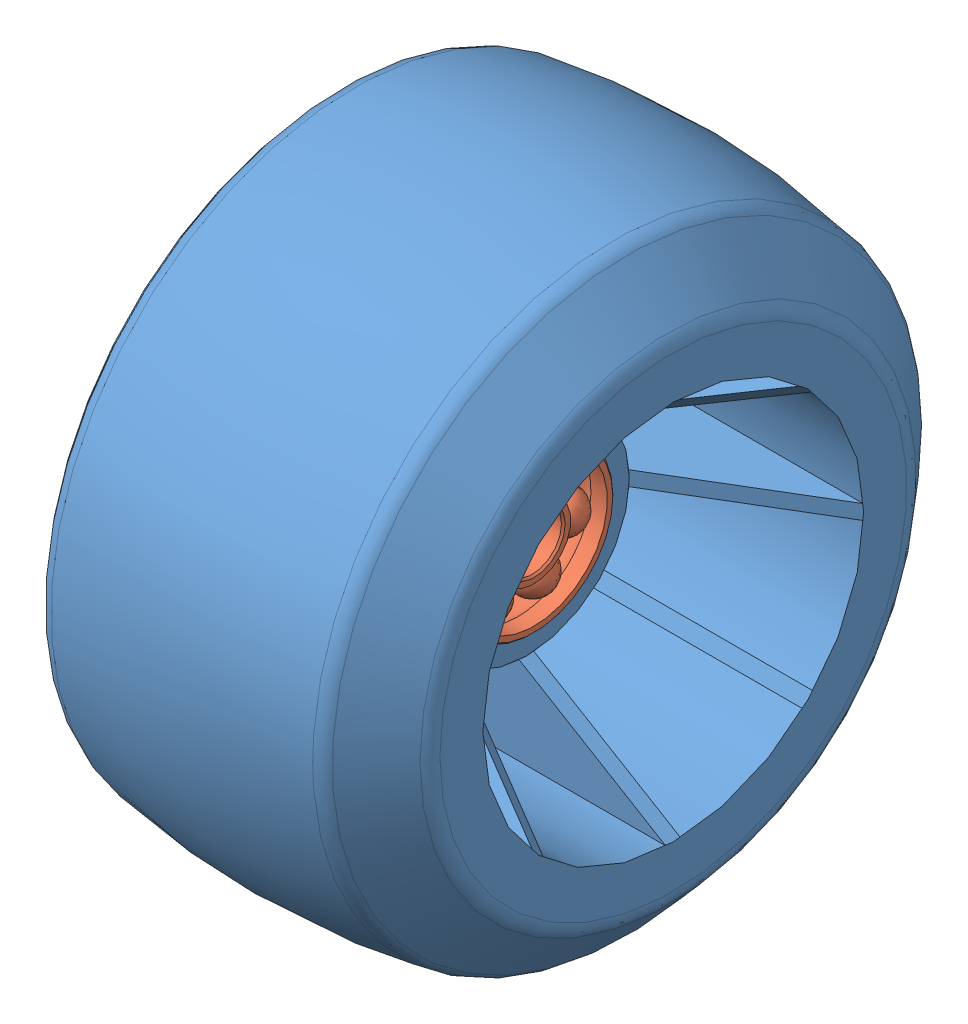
SolidWorks assembly roue assemblée.SLDASM, configuration Défaut (file format 3400). Lengths in mm.
Overall size (243.1 85.84 85.84).
5 component instances, 4 part files, 6 mates.
Components (placement in the parent):
- roue-1: roue.SLDPRT [Défaut] at (-9.632 -4.715 0) size (46 85.84 85.84)
- roulement-1: roulement.SLDPRT [Défaut] at (-9.132 -4.715 0) size (7 22 22)
- roulement-2: roulement.SLDPRT [Défaut] at (-28.632 -4.715 0) size (7 22 22)
- entretoise guidage roue-1: entretoise guidage roue.SLDPRT [Défaut] at (-12.632 -4.715 0) x (0 0 1) z (-1 0 0) size (12 12 12.5)
- Ecrou auto freiné M8-1: Ecrou auto freiné M8.SLDPRT [ISO 7040-M8-N] at (-226.672 -4.715 0) x (0 -0.629312 0.777153) z (-1 0 0) size (13 15.01 9.5)
Mates (geometry in assembly coordinates):
- Coaxiale1: concentric aligned: cylinder of roue-1; cylinder of roulement-2
- Coïncidente1: coincident anti-aligned: plane of roue-1 through (-25.132 -4.715 0) normal (-1 0 0); plane of roulement-2 through (-25.132 6.035 0) normal (1 0 0)
- Coaxiale2: concentric anti-aligned: cylinder of roulement-2; cylinder of entretoise guidage roue-1
- Coïncidente2: coincident anti-aligned: plane of roulement-2 through (-25.132 -0.465 0) normal (1 0 0); plane of entretoise guidage roue-1 through (-25.132 -4.715 0) normal (-1 0 0)
- Coaxiale3: concentric anti-aligned: cylinder of roue-1; cylinder of roulement-1
- Coïncidente3: coincident anti-aligned: plane of roulement-1 through (-12.632 -0.465 0) normal (-1 0 0); plane of entretoise guidage roue-1 through (-12.632 -4.715 0) normal (1 0 0)
